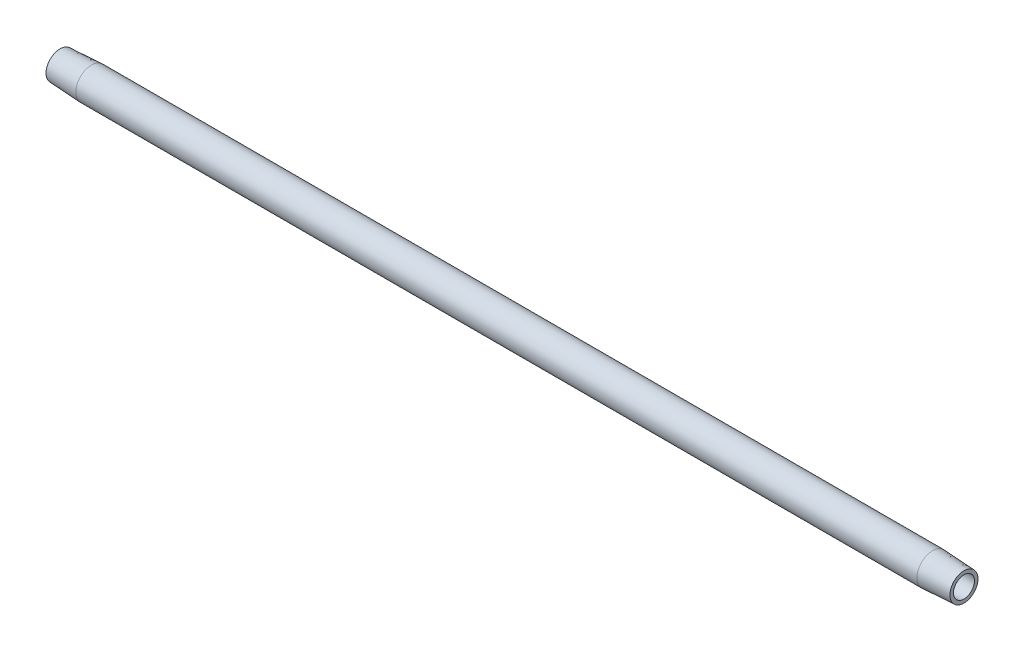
ISO-10303-21;
HEADER;
FILE_DESCRIPTION(('STEP AP214'),'2;1');
FILE_NAME('part.step','',(''),(''),'','','');
FILE_SCHEMA(('AUTOMOTIVE_DESIGN { 1 0 10303 214 1 1 1 1 }'));
ENDSEC;
DATA;
#1=APPLICATION_CONTEXT('core data for automotive mechanical design processes');
#2=APPLICATION_PROTOCOL_DEFINITION('international standard','automotive_design',2000,#1);
#3=PRODUCT_CONTEXT('',#1,'mechanical');
#4=PRODUCT('Part','Part','',(#3));
#5=PRODUCT_RELATED_PRODUCT_CATEGORY('part','',(#4));
#6=PRODUCT_DEFINITION_FORMATION('','',#4);
#7=PRODUCT_DEFINITION_CONTEXT('part definition',#1,'design');
#8=PRODUCT_DEFINITION('design','',#6,#7);
#9=PRODUCT_DEFINITION_SHAPE('','',#8);
#10=(LENGTH_UNIT() NAMED_UNIT(*) SI_UNIT(.MILLI.,.METRE.));
#11=(NAMED_UNIT(*) PLANE_ANGLE_UNIT() SI_UNIT($,.RADIAN.));
#12=(NAMED_UNIT(*) SI_UNIT($,.STERADIAN.) SOLID_ANGLE_UNIT());
#13=UNCERTAINTY_MEASURE_WITH_UNIT(LENGTH_MEASURE(1.E-05),#10,'distance_accuracy_value','');
#14=(GEOMETRIC_REPRESENTATION_CONTEXT(3) GLOBAL_UNCERTAINTY_ASSIGNED_CONTEXT((#13)) GLOBAL_UNIT_ASSIGNED_CONTEXT((#10,
#11,#12)) REPRESENTATION_CONTEXT('',''));
#15=CARTESIAN_POINT('',(0.,0.,0.));
#16=DIRECTION('',(0.,0.,1.));
#17=DIRECTION('',(1.,0.,0.));
#18=AXIS2_PLACEMENT_3D('',#15,#16,#17);
#19=CARTESIAN_POINT('',(0.476141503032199,0.,0.));
#20=DIRECTION('',(-1.,0.,0.));
#21=DIRECTION('',(0.,0.,1.));
#22=AXIS2_PLACEMENT_3D('',#19,#20,#21);
#23=CYLINDRICAL_SURFACE('',#22,3.96875);
#24=CARTESIAN_POINT('',(7.9375,0.,0.));
#25=DIRECTION('',(-1.,0.,0.));
#26=DIRECTION('',(0.,0.,1.));
#27=AXIS2_PLACEMENT_3D('',#24,#25,#26);
#28=CIRCLE('',#27,3.96875);
#29=CARTESIAN_POINT('',(7.9375,0.,3.96875));
#30=VERTEX_POINT('',#29);
#31=EDGE_CURVE('E10',#30,#30,#28,.T.);
#32=ORIENTED_EDGE('',*,*,#31,.F.);
#33=EDGE_LOOP('',(#32));
#34=FACE_BOUND('',#33,.T.);
#35=CARTESIAN_POINT('',(220.6625,0.,0.));
#36=DIRECTION('',(-1.,0.,0.));
#37=DIRECTION('',(0.,0.,1.));
#38=AXIS2_PLACEMENT_3D('',#35,#36,#37);
#39=CIRCLE('',#38,3.96875);
#40=CARTESIAN_POINT('',(220.6625,0.,3.96875));
#41=VERTEX_POINT('',#40);
#42=EDGE_CURVE('E52',#41,#41,#39,.T.);
#43=ORIENTED_EDGE('',*,*,#42,.T.);
#44=EDGE_LOOP('',(#43));
#45=FACE_BOUND('',#44,.T.);
#46=ADVANCED_FACE('F30',(#34,#45),#23,.T.);
#47=CARTESIAN_POINT('',(7.9375,0.,0.));
#48=DIRECTION('',(1.,0.,0.));
#49=DIRECTION('',(0.,0.,-1.));
#50=AXIS2_PLACEMENT_3D('',#47,#48,#49);
#51=CONICAL_SURFACE('',#50,3.96875,0.0523598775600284);
#52=CARTESIAN_POINT('',(0.,0.,0.));
#53=DIRECTION('',(-1.,0.,0.));
#54=DIRECTION('',(0.,0.,1.));
#55=AXIS2_PLACEMENT_3D('',#52,#53,#54);
#56=CIRCLE('',#55,3.55276325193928);
#57=CARTESIAN_POINT('',(0.,0.,3.55276325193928));
#58=VERTEX_POINT('',#57);
#59=EDGE_CURVE('E36',#58,#58,#56,.T.);
#60=ORIENTED_EDGE('',*,*,#59,.F.);
#61=EDGE_LOOP('',(#60));
#62=FACE_BOUND('',#61,.T.);
#63=ORIENTED_EDGE('',*,*,#31,.T.);
#64=EDGE_LOOP('',(#63));
#65=FACE_BOUND('',#64,.T.);
#66=ADVANCED_FACE('F77',(#62,#65),#51,.T.);
#67=CARTESIAN_POINT('',(0.,3.55276325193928,0.));
#68=DIRECTION('',(1.,0.,0.));
#69=DIRECTION('',(0.,0.,-1.));
#70=AXIS2_PLACEMENT_3D('',#67,#68,#69);
#71=PLANE('',#70);
#72=CARTESIAN_POINT('',(0.,0.,0.));
#73=DIRECTION('',(-1.,0.,0.));
#74=DIRECTION('',(0.,0.,1.));
#75=AXIS2_PLACEMENT_3D('',#72,#73,#74);
#76=CIRCLE('',#75,2.65429999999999);
#77=CARTESIAN_POINT('',(0.,0.,2.65429999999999));
#78=VERTEX_POINT('',#77);
#79=EDGE_CURVE('E40',#78,#78,#76,.T.);
#80=ORIENTED_EDGE('',*,*,#79,.F.);
#81=EDGE_LOOP('',(#80));
#82=FACE_BOUND('',#81,.T.);
#83=ORIENTED_EDGE('',*,*,#59,.T.);
#84=EDGE_LOOP('',(#83));
#85=FACE_BOUND('',#84,.T.);
#86=ADVANCED_FACE('F72',(#82,#85),#71,.F.);
#87=CARTESIAN_POINT('',(0.476141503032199,0.,0.));
#88=DIRECTION('',(-1.,0.,0.));
#89=DIRECTION('',(0.,0.,1.));
#90=AXIS2_PLACEMENT_3D('',#87,#88,#89);
#91=CYLINDRICAL_SURFACE('',#90,2.6543);
#92=CARTESIAN_POINT('',(228.6,0.,0.));
#93=DIRECTION('',(-1.,0.,0.));
#94=DIRECTION('',(0.,0.,1.));
#95=AXIS2_PLACEMENT_3D('',#92,#93,#94);
#96=CIRCLE('',#95,2.6543);
#97=CARTESIAN_POINT('',(228.6,0.,2.6543));
#98=VERTEX_POINT('',#97);
#99=EDGE_CURVE('E44',#98,#98,#96,.T.);
#100=ORIENTED_EDGE('',*,*,#99,.F.);
#101=EDGE_LOOP('',(#100));
#102=FACE_BOUND('',#101,.T.);
#103=ORIENTED_EDGE('',*,*,#79,.T.);
#104=EDGE_LOOP('',(#103));
#105=FACE_BOUND('',#104,.T.);
#106=ADVANCED_FACE('F66',(#102,#105),#91,.F.);
#107=CARTESIAN_POINT('',(228.6,2.6543,0.));
#108=DIRECTION('',(-1.,0.,0.));
#109=DIRECTION('',(0.,0.,1.));
#110=AXIS2_PLACEMENT_3D('',#107,#108,#109);
#111=PLANE('',#110);
#112=CARTESIAN_POINT('',(228.6,0.,0.));
#113=DIRECTION('',(-1.,0.,0.));
#114=DIRECTION('',(0.,0.,1.));
#115=AXIS2_PLACEMENT_3D('',#112,#113,#114);
#116=CIRCLE('',#115,3.55276325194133);
#117=CARTESIAN_POINT('',(228.6,0.,3.55276325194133));
#118=VERTEX_POINT('',#117);
#119=EDGE_CURVE('E49',#118,#118,#116,.T.);
#120=ORIENTED_EDGE('',*,*,#119,.F.);
#121=EDGE_LOOP('',(#120));
#122=FACE_BOUND('',#121,.T.);
#123=ORIENTED_EDGE('',*,*,#99,.T.);
#124=EDGE_LOOP('',(#123));
#125=FACE_BOUND('',#124,.T.);
#126=ADVANCED_FACE('F60',(#122,#125),#111,.F.);
#127=CARTESIAN_POINT('',(228.6,0.,0.));
#128=DIRECTION('',(-1.,0.,0.));
#129=DIRECTION('',(0.,0.,1.));
#130=AXIS2_PLACEMENT_3D('',#127,#128,#129);
#131=CONICAL_SURFACE('',#130,3.55276325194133,0.0523598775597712);
#132=ORIENTED_EDGE('',*,*,#42,.F.);
#133=EDGE_LOOP('',(#132));
#134=FACE_BOUND('',#133,.T.);
#135=ORIENTED_EDGE('',*,*,#119,.T.);
#136=EDGE_LOOP('',(#135));
#137=FACE_BOUND('',#136,.T.);
#138=ADVANCED_FACE('F57',(#134,#137),#131,.T.);
#139=CLOSED_SHELL('',(#46,#66,#86,#106,#126,#138));
#140=MANIFOLD_SOLID_BREP('B2',#139);
#141=ADVANCED_BREP_SHAPE_REPRESENTATION('',(#18,#140),#14);
#142=SHAPE_DEFINITION_REPRESENTATION(#9,#141);
ENDSEC;
END-ISO-10303-21;
